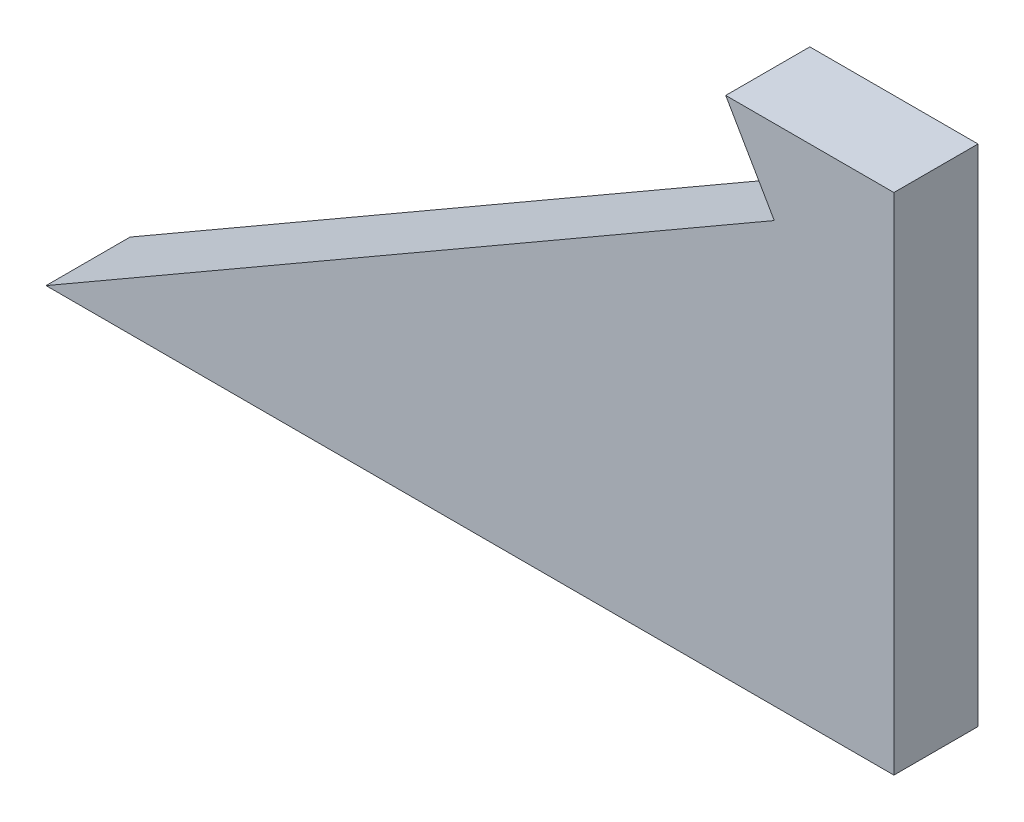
from build123d import *

# Parameters (mm, degrees)
EXTRUDE1_DEPTH = 12.7


with BuildPart() as part:
    # Sketch1 → Extrude1 (new, symmetric)
    with BuildSketch(Plane.XY):
        Polygon((-14.664696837, 25.4), (36.135303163, 25.4), (36.135303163, -127), (-219.970452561, -127), (0, 0), align=None)
    extrude(amount=EXTRUDE1_DEPTH, both=True)


solid = part.part
